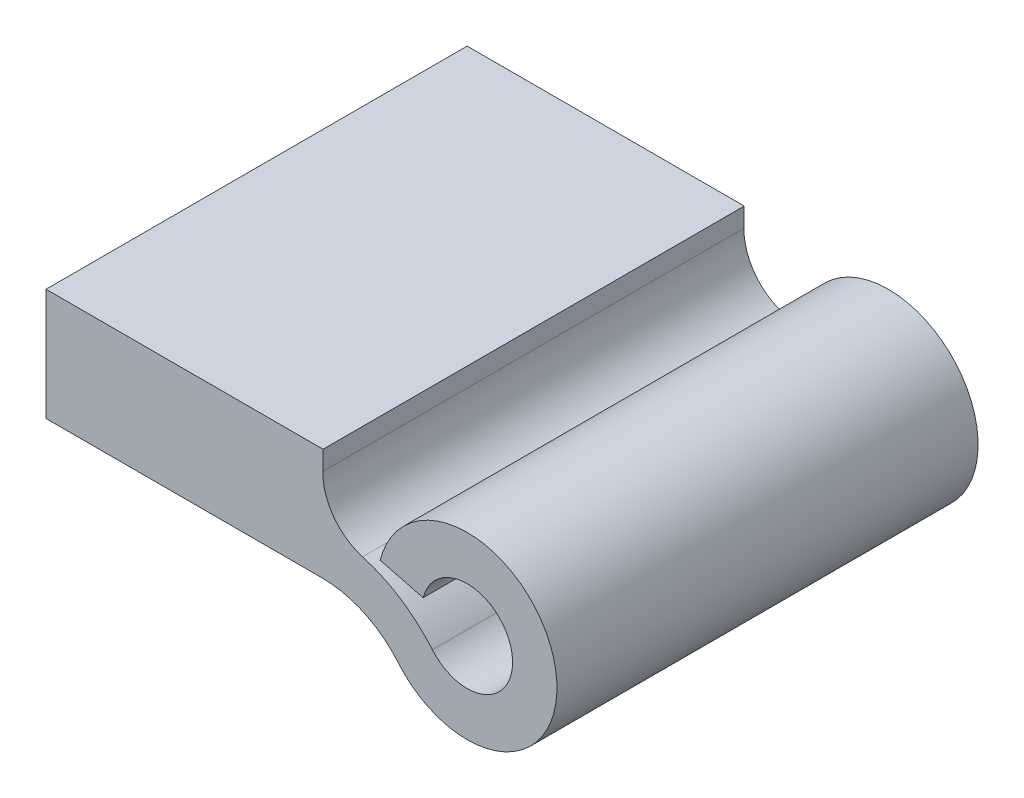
from build123d import *

# Parameters (mm, degrees)
BASE_EXTRUSION_DEPTH = 38


with BuildPart() as part:
    # Esquisse1 → Base-Extrusion (new body)
    with BuildSketch(Plane.XY):
        with BuildLine():
            Line((-38, 2), (-38, 8.1))
            Line((-38, 8.1), (-13, 8.1))
            Line((-13, 8.1), (-13.026523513, 6.348309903))
            ThreePointArc((-13.026523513, 6.348309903), (-12.05186308, 3.305919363), (-9.434115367, 1.474662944))
            ThreePointArc((-9.434115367, 1.474662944), (-5.982820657, -0.116324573), (-3.139104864, -2.637426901))
            ThreePointArc((-3.139104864, -2.637426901), (3.996987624, 0.913285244), (-3.973053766, 1.012345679))
            Line((-3.973053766, 1.012345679), (-7.849203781, 2))
            ThreePointArc((-7.849203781, 2), (7.896487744, 1.804295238), (-6.201646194, -5.210526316))
            ThreePointArc((-6.201646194, -5.210526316), (-9.291394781, -2.842020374), (-13.092364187, -2))
            Line((-13.092364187, -2), (-38, -2))
            Line((-38, -2), (-38, 2))
        make_face()
    extrude(amount=BASE_EXTRUSION_DEPTH)


solid = part.part
